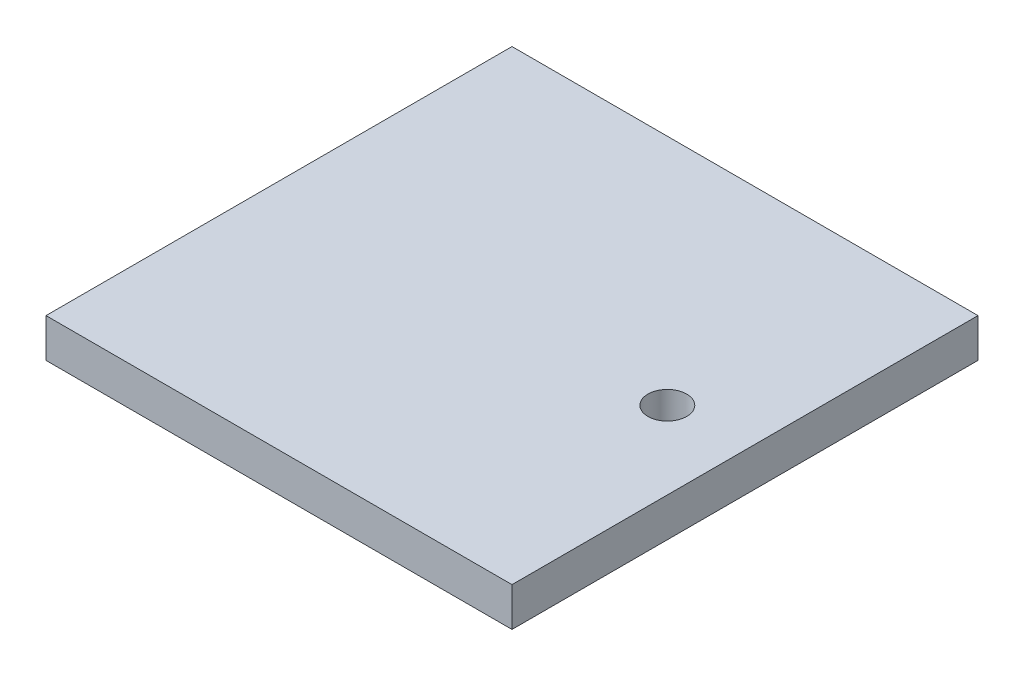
from build123d import *

# Parameters (mm, degrees)
SKETCH1_W      = 76.2
SKETCH1_H      = 76.2
SKETCH1_R      = 3.175
EXTRUDE1_DEPTH = 6.35


with BuildPart() as part:
    # Sketch1 → Extrude1 (new body)
    with BuildSketch(Plane(origin=(0, 0, 0), x_dir=(1, 0, 0), z_dir=(0, 1, 0))):
        with Locations((2.525957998, 24.678291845)):
            Rectangle(SKETCH1_W, SKETCH1_H)
        with Locations(Location((27.925957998, 24.678291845, 0), (0, 0, 270))):
            Circle(SKETCH1_R, mode=Mode.SUBTRACT)
    extrude(amount=EXTRUDE1_DEPTH)


solid = part.part
